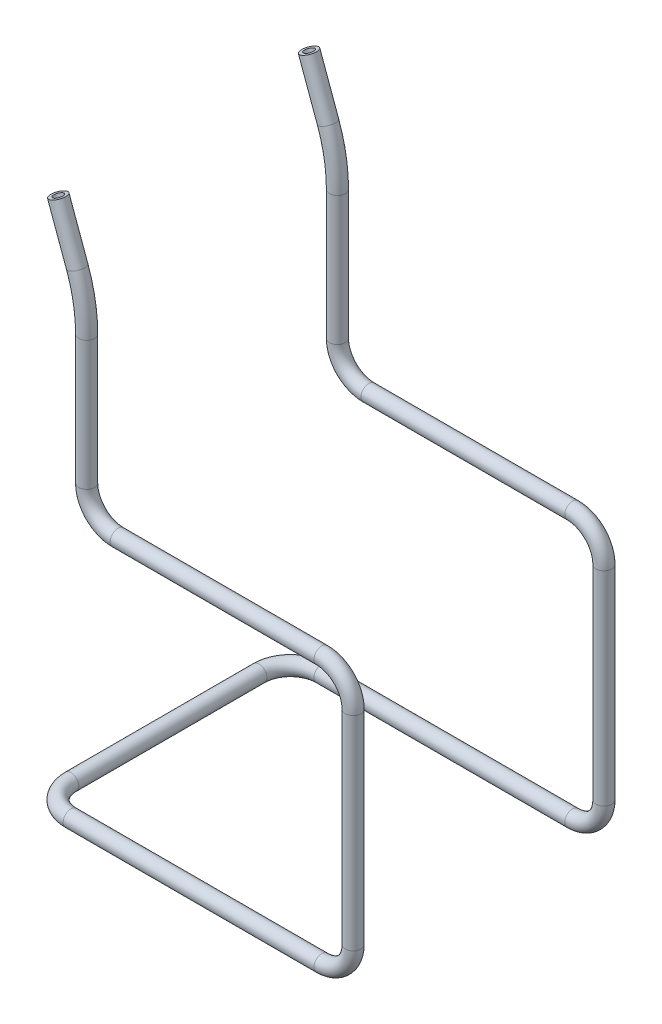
ISO-10303-21;
HEADER;
FILE_DESCRIPTION(('STEP AP214'),'2;1');
FILE_NAME('part.step','',(''),(''),'','','');
FILE_SCHEMA(('AUTOMOTIVE_DESIGN { 1 0 10303 214 1 1 1 1 }'));
ENDSEC;
DATA;
#1=APPLICATION_CONTEXT('core data for automotive mechanical design processes');
#2=APPLICATION_PROTOCOL_DEFINITION('international standard','automotive_design',2000,#1);
#3=PRODUCT_CONTEXT('',#1,'mechanical');
#4=PRODUCT('Part','Part','',(#3));
#5=PRODUCT_RELATED_PRODUCT_CATEGORY('part','',(#4));
#6=PRODUCT_DEFINITION_FORMATION('','',#4);
#7=PRODUCT_DEFINITION_CONTEXT('part definition',#1,'design');
#8=PRODUCT_DEFINITION('design','',#6,#7);
#9=PRODUCT_DEFINITION_SHAPE('','',#8);
#10=(LENGTH_UNIT() NAMED_UNIT(*) SI_UNIT(.MILLI.,.METRE.));
#11=(NAMED_UNIT(*) PLANE_ANGLE_UNIT() SI_UNIT($,.RADIAN.));
#12=(NAMED_UNIT(*) SI_UNIT($,.STERADIAN.) SOLID_ANGLE_UNIT());
#13=UNCERTAINTY_MEASURE_WITH_UNIT(LENGTH_MEASURE(1.E-05),#10,'distance_accuracy_value','');
#14=(GEOMETRIC_REPRESENTATION_CONTEXT(3) GLOBAL_UNCERTAINTY_ASSIGNED_CONTEXT((#13)) GLOBAL_UNIT_ASSIGNED_CONTEXT((#10,
#11,#12)) REPRESENTATION_CONTEXT('',''));
#15=CARTESIAN_POINT('',(0.,0.,0.));
#16=DIRECTION('',(0.,0.,1.));
#17=DIRECTION('',(1.,0.,0.));
#18=AXIS2_PLACEMENT_3D('',#15,#16,#17);
#19=CARTESIAN_POINT('',(11.9846310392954,153.279120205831,40.));
#20=DIRECTION('',(-0.342020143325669,0.939692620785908,0.));
#21=DIRECTION('',(-0.939692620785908,-0.342020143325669,0.));
#22=AXIS2_PLACEMENT_3D('',#19,#20,#21);
#23=CYLINDRICAL_SURFACE('',#22,2.5);
#24=CARTESIAN_POINT('',(11.9846310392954,153.279120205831,40.));
#25=DIRECTION('',(-0.342020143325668,0.939692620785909,0.));
#26=DIRECTION('',(0.,0.,-1.));
#27=AXIS2_PLACEMENT_3D('',#24,#25,#26);
#28=CIRCLE('',#27,2.5);
#29=CARTESIAN_POINT('',(14.3338625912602,154.134170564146,40.));
#30=VERTEX_POINT('',#29);
#31=EDGE_CURVE('E36',#30,#30,#28,.T.);
#32=ORIENTED_EDGE('',*,*,#31,.T.);
#33=EDGE_LOOP('',(#32));
#34=FACE_BOUND('',#33,.T.);
#35=CARTESIAN_POINT('',(5.93646620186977,169.896316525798,40.));
#36=DIRECTION('',(-0.342020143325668,0.939692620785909,0.));
#37=DIRECTION('',(0.,0.,-1.));
#38=AXIS2_PLACEMENT_3D('',#35,#36,#37);
#39=CIRCLE('',#38,2.5);
#40=CARTESIAN_POINT('',(5.93646620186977,169.896316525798,37.5));
#41=VERTEX_POINT('',#40);
#42=EDGE_CURVE('E10',#41,#41,#39,.T.);
#43=ORIENTED_EDGE('',*,*,#42,.F.);
#44=EDGE_LOOP('',(#43));
#45=FACE_BOUND('',#44,.T.);
#46=ADVANCED_FACE('F30',(#34,#45),#23,.T.);
#47=CARTESIAN_POINT('',(-35.,136.178113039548,40.));
#48=DIRECTION('',(0.,0.,1.));
#49=DIRECTION('',(1.,0.,0.));
#50=AXIS2_PLACEMENT_3D('',#47,#48,#49);
#51=TOROIDAL_SURFACE('',#50,50.,2.5);
#52=CARTESIAN_POINT('',(15.,136.178113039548,40.));
#53=DIRECTION('',(0.,1.,0.));
#54=DIRECTION('',(0.,0.,-1.));
#55=AXIS2_PLACEMENT_3D('',#52,#53,#54);
#56=CIRCLE('',#55,2.5);
#57=CARTESIAN_POINT('',(17.5,136.178113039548,40.));
#58=VERTEX_POINT('',#57);
#59=EDGE_CURVE('E40',#58,#58,#56,.T.);
#60=CARTESIAN_POINT('',(-35.,136.178113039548,40.));
#61=DIRECTION('',(0.,0.,1.));
#62=DIRECTION('',(1.,0.,0.));
#63=AXIS2_PLACEMENT_3D('',#60,#61,#62);
#64=CIRCLE('',#63,52.5);
#65=EDGE_CURVE('',#58,#30,#64,.T.);
#66=ORIENTED_EDGE('',*,*,#59,.T.);
#67=ORIENTED_EDGE('',*,*,#31,.F.);
#68=ORIENTED_EDGE('',*,*,#65,.T.);
#69=ORIENTED_EDGE('',*,*,#65,.F.);
#70=EDGE_LOOP('',(#66,#68,#67,#69));
#71=FACE_BOUND('',#70,.T.);
#72=ADVANCED_FACE('F188',(#71),#51,.T.);
#73=CARTESIAN_POINT('',(15.,95.,40.));
#74=DIRECTION('',(0.,1.,0.));
#75=DIRECTION('',(0.,0.,1.));
#76=AXIS2_PLACEMENT_3D('',#73,#74,#75);
#77=CYLINDRICAL_SURFACE('',#76,2.5);
#78=CARTESIAN_POINT('',(15.,95.,40.));
#79=DIRECTION('',(0.,1.,0.));
#80=DIRECTION('',(0.,0.,-1.));
#81=AXIS2_PLACEMENT_3D('',#78,#79,#80);
#82=CIRCLE('',#81,2.5);
#83=CARTESIAN_POINT('',(12.5,95.,40.));
#84=VERTEX_POINT('',#83);
#85=EDGE_CURVE('E44',#84,#84,#82,.T.);
#86=ORIENTED_EDGE('',*,*,#85,.T.);
#87=EDGE_LOOP('',(#86));
#88=FACE_BOUND('',#87,.T.);
#89=ORIENTED_EDGE('',*,*,#59,.F.);
#90=EDGE_LOOP('',(#89));
#91=FACE_BOUND('',#90,.T.);
#92=ADVANCED_FACE('F192',(#88,#91),#77,.T.);
#93=CARTESIAN_POINT('',(25.,95.,40.));
#94=DIRECTION('',(0.,0.,-1.));
#95=DIRECTION('',(-1.,0.,0.));
#96=AXIS2_PLACEMENT_3D('',#93,#94,#95);
#97=TOROIDAL_SURFACE('',#96,10.,2.5);
#98=CARTESIAN_POINT('',(25.,85.,40.));
#99=DIRECTION('',(-1.,0.,0.));
#100=DIRECTION('',(0.,0.,-1.));
#101=AXIS2_PLACEMENT_3D('',#98,#99,#100);
#102=CIRCLE('',#101,2.5);
#103=CARTESIAN_POINT('',(25.,82.5,40.));
#104=VERTEX_POINT('',#103);
#105=EDGE_CURVE('E49',#104,#104,#102,.T.);
#106=CARTESIAN_POINT('',(25.,95.,40.));
#107=DIRECTION('',(0.,0.,-1.));
#108=DIRECTION('',(-1.,0.,0.));
#109=AXIS2_PLACEMENT_3D('',#106,#107,#108);
#110=CIRCLE('',#109,12.5);
#111=EDGE_CURVE('',#104,#84,#110,.T.);
#112=ORIENTED_EDGE('',*,*,#105,.T.);
#113=ORIENTED_EDGE('',*,*,#85,.F.);
#114=ORIENTED_EDGE('',*,*,#111,.T.);
#115=ORIENTED_EDGE('',*,*,#111,.F.);
#116=EDGE_LOOP('',(#112,#114,#113,#115));
#117=FACE_BOUND('',#116,.T.);
#118=ADVANCED_FACE('F198',(#117),#97,.T.);
#119=CARTESIAN_POINT('',(90.,85.,40.));
#120=DIRECTION('',(-1.,0.,0.));
#121=DIRECTION('',(0.,0.,1.));
#122=AXIS2_PLACEMENT_3D('',#119,#120,#121);
#123=CYLINDRICAL_SURFACE('',#122,2.5);
#124=CARTESIAN_POINT('',(90.,85.,40.));
#125=DIRECTION('',(-1.,0.,0.));
#126=DIRECTION('',(0.,0.,-1.));
#127=AXIS2_PLACEMENT_3D('',#124,#125,#126);
#128=CIRCLE('',#127,2.5);
#129=CARTESIAN_POINT('',(90.,87.5,40.));
#130=VERTEX_POINT('',#129);
#131=EDGE_CURVE('E52',#130,#130,#128,.T.);
#132=ORIENTED_EDGE('',*,*,#131,.T.);
#133=EDGE_LOOP('',(#132));
#134=FACE_BOUND('',#133,.T.);
#135=ORIENTED_EDGE('',*,*,#105,.F.);
#136=EDGE_LOOP('',(#135));
#137=FACE_BOUND('',#136,.T.);
#138=ADVANCED_FACE('F205',(#134,#137),#123,.T.);
#139=CARTESIAN_POINT('',(90.,75.,40.));
#140=DIRECTION('',(0.,0.,1.));
#141=DIRECTION('',(1.,0.,0.));
#142=AXIS2_PLACEMENT_3D('',#139,#140,#141);
#143=TOROIDAL_SURFACE('',#142,9.99999999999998,2.5);
#144=CARTESIAN_POINT('',(100.,75.,40.));
#145=DIRECTION('',(0.,1.,0.));
#146=DIRECTION('',(0.,0.,-1.));
#147=AXIS2_PLACEMENT_3D('',#144,#145,#146);
#148=CIRCLE('',#147,2.5);
#149=CARTESIAN_POINT('',(102.5,75.,40.));
#150=VERTEX_POINT('',#149);
#151=EDGE_CURVE('E55',#150,#150,#148,.T.);
#152=CARTESIAN_POINT('',(90.,75.,40.));
#153=DIRECTION('',(0.,0.,1.));
#154=DIRECTION('',(1.,0.,0.));
#155=AXIS2_PLACEMENT_3D('',#152,#153,#154);
#156=CIRCLE('',#155,12.5);
#157=EDGE_CURVE('',#150,#130,#156,.T.);
#158=ORIENTED_EDGE('',*,*,#151,.T.);
#159=ORIENTED_EDGE('',*,*,#131,.F.);
#160=ORIENTED_EDGE('',*,*,#157,.T.);
#161=ORIENTED_EDGE('',*,*,#157,.F.);
#162=EDGE_LOOP('',(#158,#160,#159,#161));
#163=FACE_BOUND('',#162,.T.);
#164=ADVANCED_FACE('F209',(#163),#143,.T.);
#165=CARTESIAN_POINT('',(100.,9.99999999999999,40.));
#166=DIRECTION('',(0.,1.,0.));
#167=DIRECTION('',(0.,0.,1.));
#168=AXIS2_PLACEMENT_3D('',#165,#166,#167);
#169=CYLINDRICAL_SURFACE('',#168,2.5);
#170=CARTESIAN_POINT('',(100.,9.99999999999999,40.));
#171=DIRECTION('',(0.,1.,0.));
#172=DIRECTION('',(0.,0.,-1.));
#173=AXIS2_PLACEMENT_3D('',#170,#171,#172);
#174=CIRCLE('',#173,2.5);
#175=CARTESIAN_POINT('',(102.5,9.99999999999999,40.));
#176=VERTEX_POINT('',#175);
#177=EDGE_CURVE('E58',#176,#176,#174,.T.);
#178=ORIENTED_EDGE('',*,*,#177,.T.);
#179=EDGE_LOOP('',(#178));
#180=FACE_BOUND('',#179,.T.);
#181=ORIENTED_EDGE('',*,*,#151,.F.);
#182=EDGE_LOOP('',(#181));
#183=FACE_BOUND('',#182,.T.);
#184=ADVANCED_FACE('F213',(#180,#183),#169,.T.);
#185=CARTESIAN_POINT('',(90.,10.,40.));
#186=DIRECTION('',(0.,0.,1.));
#187=DIRECTION('',(1.,0.,0.));
#188=AXIS2_PLACEMENT_3D('',#185,#186,#187);
#189=TOROIDAL_SURFACE('',#188,10.,2.5);
#190=CARTESIAN_POINT('',(90.,0.,40.));
#191=DIRECTION('',(1.,0.,0.));
#192=DIRECTION('',(0.,0.,-1.));
#193=AXIS2_PLACEMENT_3D('',#190,#191,#192);
#194=CIRCLE('',#193,2.5);
#195=CARTESIAN_POINT('',(90.,-2.5,40.));
#196=VERTEX_POINT('',#195);
#197=EDGE_CURVE('E61',#196,#196,#194,.T.);
#198=CARTESIAN_POINT('',(90.,10.,40.));
#199=DIRECTION('',(0.,0.,1.));
#200=DIRECTION('',(1.,0.,0.));
#201=AXIS2_PLACEMENT_3D('',#198,#199,#200);
#202=CIRCLE('',#201,12.5);
#203=EDGE_CURVE('',#196,#176,#202,.T.);
#204=ORIENTED_EDGE('',*,*,#197,.T.);
#205=ORIENTED_EDGE('',*,*,#177,.F.);
#206=ORIENTED_EDGE('',*,*,#203,.T.);
#207=ORIENTED_EDGE('',*,*,#203,.F.);
#208=EDGE_LOOP('',(#204,#206,#205,#207));
#209=FACE_BOUND('',#208,.T.);
#210=ADVANCED_FACE('F217',(#209),#189,.T.);
#211=CARTESIAN_POINT('',(10.,0.,40.));
#212=DIRECTION('',(1.,0.,0.));
#213=DIRECTION('',(0.,0.,-1.));
#214=AXIS2_PLACEMENT_3D('',#211,#212,#213);
#215=CYLINDRICAL_SURFACE('',#214,2.5);
#216=CARTESIAN_POINT('',(10.,0.,40.));
#217=DIRECTION('',(1.,0.,0.));
#218=DIRECTION('',(0.,0.,-1.));
#219=AXIS2_PLACEMENT_3D('',#216,#217,#218);
#220=CIRCLE('',#219,2.5);
#221=CARTESIAN_POINT('',(10.,0.,42.5));
#222=VERTEX_POINT('',#221);
#223=EDGE_CURVE('E64',#222,#222,#220,.T.);
#224=ORIENTED_EDGE('',*,*,#223,.T.);
#225=EDGE_LOOP('',(#224));
#226=FACE_BOUND('',#225,.T.);
#227=ORIENTED_EDGE('',*,*,#197,.F.);
#228=EDGE_LOOP('',(#227));
#229=FACE_BOUND('',#228,.T.);
#230=ADVANCED_FACE('F221',(#226,#229),#215,.T.);
#231=CARTESIAN_POINT('',(10.,0.,30.));
#232=DIRECTION('',(0.,1.,0.));
#233=DIRECTION('',(0.,0.,1.));
#234=AXIS2_PLACEMENT_3D('',#231,#232,#233);
#235=TOROIDAL_SURFACE('',#234,10.,2.5);
#236=CARTESIAN_POINT('',(0.,0.,30.));
#237=DIRECTION('',(0.,0.,1.));
#238=DIRECTION('',(1.,0.,0.));
#239=AXIS2_PLACEMENT_3D('',#236,#237,#238);
#240=CIRCLE('',#239,2.5);
#241=CARTESIAN_POINT('',(-2.5,0.,30.));
#242=VERTEX_POINT('',#241);
#243=EDGE_CURVE('E67',#242,#242,#240,.T.);
#244=CARTESIAN_POINT('',(10.,0.,30.));
#245=DIRECTION('',(0.,1.,0.));
#246=DIRECTION('',(0.,0.,1.));
#247=AXIS2_PLACEMENT_3D('',#244,#245,#246);
#248=CIRCLE('',#247,12.5);
#249=EDGE_CURVE('',#242,#222,#248,.T.);
#250=ORIENTED_EDGE('',*,*,#243,.T.);
#251=ORIENTED_EDGE('',*,*,#223,.F.);
#252=ORIENTED_EDGE('',*,*,#249,.T.);
#253=ORIENTED_EDGE('',*,*,#249,.F.);
#254=EDGE_LOOP('',(#250,#252,#251,#253));
#255=FACE_BOUND('',#254,.T.);
#256=ADVANCED_FACE('F225',(#255),#235,.T.);
#257=CARTESIAN_POINT('',(0.,0.,30.));
#258=DIRECTION('',(0.,0.,-1.));
#259=DIRECTION('',(-1.,0.,0.));
#260=AXIS2_PLACEMENT_3D('',#257,#258,#259);
#261=CYLINDRICAL_SURFACE('',#260,2.5);
#262=ORIENTED_EDGE('',*,*,#243,.F.);
#263=EDGE_LOOP('',(#262));
#264=FACE_BOUND('',#263,.T.);
#265=CARTESIAN_POINT('',(0.,0.,-30.));
#266=DIRECTION('',(0.,0.,1.));
#267=DIRECTION('',(1.,0.,0.));
#268=AXIS2_PLACEMENT_3D('',#265,#266,#267);
#269=CIRCLE('',#268,2.5);
#270=CARTESIAN_POINT('',(-2.5,0.,-30.));
#271=VERTEX_POINT('',#270);
#272=EDGE_CURVE('E133',#271,#271,#269,.T.);
#273=ORIENTED_EDGE('',*,*,#272,.T.);
#274=EDGE_LOOP('',(#273));
#275=FACE_BOUND('',#274,.T.);
#276=ADVANCED_FACE('F229',(#264,#275),#261,.T.);
#277=CARTESIAN_POINT('',(5.93646620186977,169.896316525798,40.));
#278=DIRECTION('',(-0.342020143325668,0.939692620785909,0.));
#279=DIRECTION('',(0.,0.,-1.));
#280=AXIS2_PLACEMENT_3D('',#277,#278,#279);
#281=PLANE('',#280);
#282=CARTESIAN_POINT('',(5.93646620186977,169.896316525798,40.));
#283=DIRECTION('',(-0.342020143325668,0.939692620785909,0.));
#284=DIRECTION('',(-0.939692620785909,-0.342020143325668,0.));
#285=AXIS2_PLACEMENT_3D('',#282,#283,#284);
#286=CIRCLE('',#285,1.5);
#287=CARTESIAN_POINT('',(4.5269272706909,169.383286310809,40.));
#288=VERTEX_POINT('',#287);
#289=EDGE_CURVE('E70',#288,#288,#286,.T.);
#290=ORIENTED_EDGE('',*,*,#289,.F.);
#291=EDGE_LOOP('',(#290));
#292=FACE_BOUND('',#291,.T.);
#293=ORIENTED_EDGE('',*,*,#42,.T.);
#294=EDGE_LOOP('',(#293));
#295=FACE_BOUND('',#294,.T.);
#296=ADVANCED_FACE('F233',(#292,#295),#281,.T.);
#297=CARTESIAN_POINT('',(11.9846310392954,153.279120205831,40.));
#298=DIRECTION('',(-0.342020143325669,0.939692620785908,0.));
#299=DIRECTION('',(-0.939692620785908,-0.342020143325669,0.));
#300=AXIS2_PLACEMENT_3D('',#297,#298,#299);
#301=CYLINDRICAL_SURFACE('',#300,1.5);
#302=CARTESIAN_POINT('',(11.9846310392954,153.279120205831,40.));
#303=DIRECTION('',(-0.342020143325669,0.939692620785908,0.));
#304=DIRECTION('',(-0.939692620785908,-0.342020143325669,0.));
#305=AXIS2_PLACEMENT_3D('',#302,#303,#304);
#306=CIRCLE('',#305,1.5);
#307=CARTESIAN_POINT('',(13.3941699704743,153.79215042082,40.));
#308=VERTEX_POINT('',#307);
#309=EDGE_CURVE('E73',#308,#308,#306,.T.);
#310=ORIENTED_EDGE('',*,*,#309,.F.);
#311=EDGE_LOOP('',(#310));
#312=FACE_BOUND('',#311,.T.);
#313=ORIENTED_EDGE('',*,*,#289,.T.);
#314=EDGE_LOOP('',(#313));
#315=FACE_BOUND('',#314,.T.);
#316=ADVANCED_FACE('F237',(#312,#315),#301,.F.);
#317=CARTESIAN_POINT('',(-35.,136.178113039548,40.));
#318=DIRECTION('',(0.,0.,1.));
#319=DIRECTION('',(1.,0.,0.));
#320=AXIS2_PLACEMENT_3D('',#317,#318,#319);
#321=TOROIDAL_SURFACE('',#320,50.,1.5);
#322=CARTESIAN_POINT('',(15.,136.178113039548,40.));
#323=DIRECTION('',(0.,-1.,0.));
#324=DIRECTION('',(1.,0.,0.));
#325=AXIS2_PLACEMENT_3D('',#322,#323,#324);
#326=CIRCLE('',#325,1.5);
#327=CARTESIAN_POINT('',(16.5,136.178113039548,40.));
#328=VERTEX_POINT('',#327);
#329=EDGE_CURVE('E99',#328,#328,#326,.F.);
#330=CARTESIAN_POINT('',(-35.,136.178113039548,40.));
#331=DIRECTION('',(0.,0.,1.));
#332=DIRECTION('',(1.,0.,0.));
#333=AXIS2_PLACEMENT_3D('',#330,#331,#332);
#334=CIRCLE('',#333,51.5);
#335=EDGE_CURVE('',#328,#308,#334,.T.);
#336=ORIENTED_EDGE('',*,*,#329,.F.);
#337=ORIENTED_EDGE('',*,*,#309,.T.);
#338=ORIENTED_EDGE('',*,*,#335,.T.);
#339=ORIENTED_EDGE('',*,*,#335,.F.);
#340=EDGE_LOOP('',(#336,#338,#337,#339));
#341=FACE_BOUND('',#340,.T.);
#342=ADVANCED_FACE('F275',(#341),#321,.F.);
#343=CARTESIAN_POINT('',(15.,95.,40.));
#344=DIRECTION('',(0.,1.,0.));
#345=DIRECTION('',(0.,0.,1.));
#346=AXIS2_PLACEMENT_3D('',#343,#344,#345);
#347=CYLINDRICAL_SURFACE('',#346,1.5);
#348=CARTESIAN_POINT('',(15.,95.,40.));
#349=DIRECTION('',(0.,1.,0.));
#350=DIRECTION('',(0.,0.,1.));
#351=AXIS2_PLACEMENT_3D('',#348,#349,#350);
#352=CIRCLE('',#351,1.5);
#353=CARTESIAN_POINT('',(13.5,95.,40.));
#354=VERTEX_POINT('',#353);
#355=EDGE_CURVE('E96',#354,#354,#352,.T.);
#356=ORIENTED_EDGE('',*,*,#355,.F.);
#357=EDGE_LOOP('',(#356));
#358=FACE_BOUND('',#357,.T.);
#359=ORIENTED_EDGE('',*,*,#329,.T.);
#360=EDGE_LOOP('',(#359));
#361=FACE_BOUND('',#360,.T.);
#362=ADVANCED_FACE('F271',(#358,#361),#347,.F.);
#363=CARTESIAN_POINT('',(25.,95.,40.));
#364=DIRECTION('',(0.,0.,-1.));
#365=DIRECTION('',(-1.,0.,0.));
#366=AXIS2_PLACEMENT_3D('',#363,#364,#365);
#367=TOROIDAL_SURFACE('',#366,10.,1.5);
#368=CARTESIAN_POINT('',(25.,85.,40.));
#369=DIRECTION('',(1.,0.,0.));
#370=DIRECTION('',(0.,1.,0.));
#371=AXIS2_PLACEMENT_3D('',#368,#369,#370);
#372=CIRCLE('',#371,1.5);
#373=CARTESIAN_POINT('',(25.,83.5,40.));
#374=VERTEX_POINT('',#373);
#375=EDGE_CURVE('E93',#374,#374,#372,.F.);
#376=CARTESIAN_POINT('',(25.,95.,40.));
#377=DIRECTION('',(0.,0.,-1.));
#378=DIRECTION('',(-1.,0.,0.));
#379=AXIS2_PLACEMENT_3D('',#376,#377,#378);
#380=CIRCLE('',#379,11.5);
#381=EDGE_CURVE('',#374,#354,#380,.T.);
#382=ORIENTED_EDGE('',*,*,#375,.F.);
#383=ORIENTED_EDGE('',*,*,#355,.T.);
#384=ORIENTED_EDGE('',*,*,#381,.T.);
#385=ORIENTED_EDGE('',*,*,#381,.F.);
#386=EDGE_LOOP('',(#382,#384,#383,#385));
#387=FACE_BOUND('',#386,.T.);
#388=ADVANCED_FACE('F267',(#387),#367,.F.);
#389=CARTESIAN_POINT('',(90.,85.,40.));
#390=DIRECTION('',(-1.,0.,0.));
#391=DIRECTION('',(0.,0.,1.));
#392=AXIS2_PLACEMENT_3D('',#389,#390,#391);
#393=CYLINDRICAL_SURFACE('',#392,1.5);
#394=CARTESIAN_POINT('',(90.,85.,40.));
#395=DIRECTION('',(-1.,0.,0.));
#396=DIRECTION('',(0.,0.,1.));
#397=AXIS2_PLACEMENT_3D('',#394,#395,#396);
#398=CIRCLE('',#397,1.5);
#399=CARTESIAN_POINT('',(90.,86.5,40.));
#400=VERTEX_POINT('',#399);
#401=EDGE_CURVE('E90',#400,#400,#398,.T.);
#402=ORIENTED_EDGE('',*,*,#401,.F.);
#403=EDGE_LOOP('',(#402));
#404=FACE_BOUND('',#403,.T.);
#405=ORIENTED_EDGE('',*,*,#375,.T.);
#406=EDGE_LOOP('',(#405));
#407=FACE_BOUND('',#406,.T.);
#408=ADVANCED_FACE('F263',(#404,#407),#393,.F.);
#409=CARTESIAN_POINT('',(90.,75.,40.));
#410=DIRECTION('',(0.,0.,1.));
#411=DIRECTION('',(1.,0.,0.));
#412=AXIS2_PLACEMENT_3D('',#409,#410,#411);
#413=TOROIDAL_SURFACE('',#412,9.99999999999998,1.5);
#414=CARTESIAN_POINT('',(100.,75.,40.));
#415=DIRECTION('',(0.,-1.,0.));
#416=DIRECTION('',(0.,0.,-1.));
#417=AXIS2_PLACEMENT_3D('',#414,#415,#416);
#418=CIRCLE('',#417,1.5);
#419=CARTESIAN_POINT('',(101.5,75.,40.));
#420=VERTEX_POINT('',#419);
#421=EDGE_CURVE('E87',#420,#420,#418,.F.);
#422=CARTESIAN_POINT('',(90.,75.,40.));
#423=DIRECTION('',(0.,0.,1.));
#424=DIRECTION('',(1.,0.,0.));
#425=AXIS2_PLACEMENT_3D('',#422,#423,#424);
#426=CIRCLE('',#425,11.5);
#427=EDGE_CURVE('',#420,#400,#426,.T.);
#428=ORIENTED_EDGE('',*,*,#421,.F.);
#429=ORIENTED_EDGE('',*,*,#401,.T.);
#430=ORIENTED_EDGE('',*,*,#427,.T.);
#431=ORIENTED_EDGE('',*,*,#427,.F.);
#432=EDGE_LOOP('',(#428,#430,#429,#431));
#433=FACE_BOUND('',#432,.T.);
#434=ADVANCED_FACE('F259',(#433),#413,.F.);
#435=CARTESIAN_POINT('',(100.,9.99999999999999,40.));
#436=DIRECTION('',(0.,1.,0.));
#437=DIRECTION('',(0.,0.,1.));
#438=AXIS2_PLACEMENT_3D('',#435,#436,#437);
#439=CYLINDRICAL_SURFACE('',#438,1.5);
#440=CARTESIAN_POINT('',(100.,9.99999999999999,40.));
#441=DIRECTION('',(0.,1.,0.));
#442=DIRECTION('',(0.,0.,1.));
#443=AXIS2_PLACEMENT_3D('',#440,#441,#442);
#444=CIRCLE('',#443,1.5);
#445=CARTESIAN_POINT('',(101.5,9.99999999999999,40.));
#446=VERTEX_POINT('',#445);
#447=EDGE_CURVE('E84',#446,#446,#444,.T.);
#448=ORIENTED_EDGE('',*,*,#447,.F.);
#449=EDGE_LOOP('',(#448));
#450=FACE_BOUND('',#449,.T.);
#451=ORIENTED_EDGE('',*,*,#421,.T.);
#452=EDGE_LOOP('',(#451));
#453=FACE_BOUND('',#452,.T.);
#454=ADVANCED_FACE('F255',(#450,#453),#439,.F.);
#455=CARTESIAN_POINT('',(90.,10.,40.));
#456=DIRECTION('',(0.,0.,1.));
#457=DIRECTION('',(1.,0.,0.));
#458=AXIS2_PLACEMENT_3D('',#455,#456,#457);
#459=TOROIDAL_SURFACE('',#458,10.,1.5);
#460=CARTESIAN_POINT('',(90.,0.,40.));
#461=DIRECTION('',(-1.,0.,0.));
#462=DIRECTION('',(0.,-1.,0.));
#463=AXIS2_PLACEMENT_3D('',#460,#461,#462);
#464=CIRCLE('',#463,1.5);
#465=CARTESIAN_POINT('',(90.,-1.5,40.));
#466=VERTEX_POINT('',#465);
#467=EDGE_CURVE('E81',#466,#466,#464,.F.);
#468=CARTESIAN_POINT('',(90.,10.,40.));
#469=DIRECTION('',(0.,0.,1.));
#470=DIRECTION('',(1.,0.,0.));
#471=AXIS2_PLACEMENT_3D('',#468,#469,#470);
#472=CIRCLE('',#471,11.5);
#473=EDGE_CURVE('',#466,#446,#472,.T.);
#474=ORIENTED_EDGE('',*,*,#467,.F.);
#475=ORIENTED_EDGE('',*,*,#447,.T.);
#476=ORIENTED_EDGE('',*,*,#473,.T.);
#477=ORIENTED_EDGE('',*,*,#473,.F.);
#478=EDGE_LOOP('',(#474,#476,#475,#477));
#479=FACE_BOUND('',#478,.T.);
#480=ADVANCED_FACE('F251',(#479),#459,.F.);
#481=CARTESIAN_POINT('',(10.,0.,40.));
#482=DIRECTION('',(1.,0.,0.));
#483=DIRECTION('',(0.,0.,-1.));
#484=AXIS2_PLACEMENT_3D('',#481,#482,#483);
#485=CYLINDRICAL_SURFACE('',#484,1.5);
#486=CARTESIAN_POINT('',(10.,0.,40.));
#487=DIRECTION('',(1.,0.,0.));
#488=DIRECTION('',(0.,0.,-1.));
#489=AXIS2_PLACEMENT_3D('',#486,#487,#488);
#490=CIRCLE('',#489,1.5);
#491=CARTESIAN_POINT('',(10.,0.,41.5));
#492=VERTEX_POINT('',#491);
#493=EDGE_CURVE('E77',#492,#492,#490,.T.);
#494=ORIENTED_EDGE('',*,*,#493,.F.);
#495=EDGE_LOOP('',(#494));
#496=FACE_BOUND('',#495,.T.);
#497=ORIENTED_EDGE('',*,*,#467,.T.);
#498=EDGE_LOOP('',(#497));
#499=FACE_BOUND('',#498,.T.);
#500=ADVANCED_FACE('F247',(#496,#499),#485,.F.);
#501=CARTESIAN_POINT('',(10.,0.,30.));
#502=DIRECTION('',(0.,1.,0.));
#503=DIRECTION('',(0.,0.,1.));
#504=AXIS2_PLACEMENT_3D('',#501,#502,#503);
#505=TOROIDAL_SURFACE('',#504,10.,1.5);
#506=CARTESIAN_POINT('',(0.,0.,30.));
#507=DIRECTION('',(0.,0.,-1.));
#508=DIRECTION('',(-1.,0.,0.));
#509=AXIS2_PLACEMENT_3D('',#506,#507,#508);
#510=CIRCLE('',#509,1.5);
#511=CARTESIAN_POINT('',(-1.5,0.,30.));
#512=VERTEX_POINT('',#511);
#513=EDGE_CURVE('E74',#512,#512,#510,.F.);
#514=CARTESIAN_POINT('',(10.,0.,30.));
#515=DIRECTION('',(0.,1.,0.));
#516=DIRECTION('',(0.,0.,1.));
#517=AXIS2_PLACEMENT_3D('',#514,#515,#516);
#518=CIRCLE('',#517,11.5);
#519=EDGE_CURVE('',#512,#492,#518,.T.);
#520=ORIENTED_EDGE('',*,*,#513,.F.);
#521=ORIENTED_EDGE('',*,*,#493,.T.);
#522=ORIENTED_EDGE('',*,*,#519,.T.);
#523=ORIENTED_EDGE('',*,*,#519,.F.);
#524=EDGE_LOOP('',(#520,#522,#521,#523));
#525=FACE_BOUND('',#524,.T.);
#526=ADVANCED_FACE('F243',(#525),#505,.F.);
#527=CARTESIAN_POINT('',(0.,0.,30.));
#528=DIRECTION('',(0.,0.,-1.));
#529=DIRECTION('',(-1.,0.,0.));
#530=AXIS2_PLACEMENT_3D('',#527,#528,#529);
#531=CYLINDRICAL_SURFACE('',#530,1.5);
#532=ORIENTED_EDGE('',*,*,#513,.T.);
#533=EDGE_LOOP('',(#532));
#534=FACE_BOUND('',#533,.T.);
#535=CARTESIAN_POINT('',(0.,0.,-30.));
#536=DIRECTION('',(0.,0.,1.));
#537=DIRECTION('',(1.,0.,0.));
#538=AXIS2_PLACEMENT_3D('',#535,#536,#537);
#539=CIRCLE('',#538,1.5);
#540=CARTESIAN_POINT('',(-1.5,0.,-30.));
#541=VERTEX_POINT('',#540);
#542=EDGE_CURVE('E140',#541,#541,#539,.T.);
#543=ORIENTED_EDGE('',*,*,#542,.F.);
#544=EDGE_LOOP('',(#543));
#545=FACE_BOUND('',#544,.T.);
#546=ADVANCED_FACE('F239',(#534,#545),#531,.F.);
#547=CARTESIAN_POINT('',(5.93646620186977,169.896316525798,-40.));
#548=DIRECTION('',(-0.342020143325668,0.939692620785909,0.));
#549=DIRECTION('',(0.,0.,1.));
#550=AXIS2_PLACEMENT_3D('',#547,#548,#549);
#551=PLANE('',#550);
#552=CARTESIAN_POINT('',(5.93646620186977,169.896316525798,-40.));
#553=DIRECTION('',(0.342020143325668,-0.939692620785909,0.));
#554=DIRECTION('',(0.,0.,1.));
#555=AXIS2_PLACEMENT_3D('',#552,#553,#554);
#556=CIRCLE('',#555,2.5);
#557=CARTESIAN_POINT('',(5.93646620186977,169.896316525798,-37.5));
#558=VERTEX_POINT('',#557);
#559=EDGE_CURVE('E78',#558,#558,#556,.T.);
#560=ORIENTED_EDGE('',*,*,#559,.F.);
#561=EDGE_LOOP('',(#560));
#562=FACE_BOUND('',#561,.T.);
#563=CARTESIAN_POINT('',(5.93646620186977,169.896316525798,-40.));
#564=DIRECTION('',(-0.342020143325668,0.939692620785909,0.));
#565=DIRECTION('',(-0.939692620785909,-0.342020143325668,0.));
#566=AXIS2_PLACEMENT_3D('',#563,#564,#565);
#567=CIRCLE('',#566,1.5);
#568=CARTESIAN_POINT('',(4.5269272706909,169.383286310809,-40.));
#569=VERTEX_POINT('',#568);
#570=EDGE_CURVE('E136',#569,#569,#567,.F.);
#571=ORIENTED_EDGE('',*,*,#570,.T.);
#572=EDGE_LOOP('',(#571));
#573=FACE_BOUND('',#572,.T.);
#574=ADVANCED_FACE('F242',(#562,#573),#551,.T.);
#575=CARTESIAN_POINT('',(11.9846310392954,153.279120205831,-40.));
#576=DIRECTION('',(-0.342020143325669,0.939692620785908,0.));
#577=DIRECTION('',(-0.939692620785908,-0.342020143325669,0.));
#578=AXIS2_PLACEMENT_3D('',#575,#576,#577);
#579=CYLINDRICAL_SURFACE('',#578,2.5);
#580=CARTESIAN_POINT('',(11.9846310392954,153.279120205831,-40.));
#581=DIRECTION('',(0.342020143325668,-0.939692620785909,0.));
#582=DIRECTION('',(0.,0.,1.));
#583=AXIS2_PLACEMENT_3D('',#580,#581,#582);
#584=CIRCLE('',#583,2.5);
#585=CARTESIAN_POINT('',(14.3338625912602,154.134170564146,-40.));
#586=VERTEX_POINT('',#585);
#587=EDGE_CURVE('E106',#586,#586,#584,.T.);
#588=ORIENTED_EDGE('',*,*,#587,.F.);
#589=EDGE_LOOP('',(#588));
#590=FACE_BOUND('',#589,.T.);
#591=ORIENTED_EDGE('',*,*,#559,.T.);
#592=EDGE_LOOP('',(#591));
#593=FACE_BOUND('',#592,.T.);
#594=ADVANCED_FACE('F283',(#590,#593),#579,.T.);
#595=CARTESIAN_POINT('',(-35.,136.178113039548,-40.));
#596=DIRECTION('',(0.,0.,1.));
#597=DIRECTION('',(1.,0.,0.));
#598=AXIS2_PLACEMENT_3D('',#595,#596,#597);
#599=TOROIDAL_SURFACE('',#598,50.,2.5);
#600=CARTESIAN_POINT('',(15.,136.178113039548,-40.));
#601=DIRECTION('',(0.,-1.,0.));
#602=DIRECTION('',(0.,0.,1.));
#603=AXIS2_PLACEMENT_3D('',#600,#601,#602);
#604=CIRCLE('',#603,2.5);
#605=CARTESIAN_POINT('',(17.5,136.178113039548,-40.));
#606=VERTEX_POINT('',#605);
#607=EDGE_CURVE('E109',#606,#606,#604,.T.);
#608=CARTESIAN_POINT('',(-35.,136.178113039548,-40.));
#609=DIRECTION('',(0.,0.,1.));
#610=DIRECTION('',(1.,0.,0.));
#611=AXIS2_PLACEMENT_3D('',#608,#609,#610);
#612=CIRCLE('',#611,52.5);
#613=EDGE_CURVE('',#606,#586,#612,.T.);
#614=ORIENTED_EDGE('',*,*,#607,.F.);
#615=ORIENTED_EDGE('',*,*,#587,.T.);
#616=ORIENTED_EDGE('',*,*,#613,.T.);
#617=ORIENTED_EDGE('',*,*,#613,.F.);
#618=EDGE_LOOP('',(#614,#616,#615,#617));
#619=FACE_BOUND('',#618,.T.);
#620=ADVANCED_FACE('F286',(#619),#599,.T.);
#621=CARTESIAN_POINT('',(15.,95.,-40.));
#622=DIRECTION('',(0.,1.,0.));
#623=DIRECTION('',(0.,0.,1.));
#624=AXIS2_PLACEMENT_3D('',#621,#622,#623);
#625=CYLINDRICAL_SURFACE('',#624,2.5);
#626=CARTESIAN_POINT('',(15.,95.,-40.));
#627=DIRECTION('',(0.,-1.,0.));
#628=DIRECTION('',(0.,0.,1.));
#629=AXIS2_PLACEMENT_3D('',#626,#627,#628);
#630=CIRCLE('',#629,2.5);
#631=CARTESIAN_POINT('',(12.5,95.,-40.));
#632=VERTEX_POINT('',#631);
#633=EDGE_CURVE('E112',#632,#632,#630,.T.);
#634=ORIENTED_EDGE('',*,*,#633,.F.);
#635=EDGE_LOOP('',(#634));
#636=FACE_BOUND('',#635,.T.);
#637=ORIENTED_EDGE('',*,*,#607,.T.);
#638=EDGE_LOOP('',(#637));
#639=FACE_BOUND('',#638,.T.);
#640=ADVANCED_FACE('F290',(#636,#639),#625,.T.);
#641=CARTESIAN_POINT('',(25.,95.,-40.));
#642=DIRECTION('',(0.,0.,-1.));
#643=DIRECTION('',(-1.,0.,0.));
#644=AXIS2_PLACEMENT_3D('',#641,#642,#643);
#645=TOROIDAL_SURFACE('',#644,10.,2.5);
#646=CARTESIAN_POINT('',(25.,85.,-40.));
#647=DIRECTION('',(1.,0.,0.));
#648=DIRECTION('',(0.,0.,1.));
#649=AXIS2_PLACEMENT_3D('',#646,#647,#648);
#650=CIRCLE('',#649,2.5);
#651=CARTESIAN_POINT('',(25.,82.5,-40.));
#652=VERTEX_POINT('',#651);
#653=EDGE_CURVE('E115',#652,#652,#650,.T.);
#654=CARTESIAN_POINT('',(25.,95.,-40.));
#655=DIRECTION('',(0.,0.,-1.));
#656=DIRECTION('',(-1.,0.,0.));
#657=AXIS2_PLACEMENT_3D('',#654,#655,#656);
#658=CIRCLE('',#657,12.5);
#659=EDGE_CURVE('',#652,#632,#658,.T.);
#660=ORIENTED_EDGE('',*,*,#653,.F.);
#661=ORIENTED_EDGE('',*,*,#633,.T.);
#662=ORIENTED_EDGE('',*,*,#659,.T.);
#663=ORIENTED_EDGE('',*,*,#659,.F.);
#664=EDGE_LOOP('',(#660,#662,#661,#663));
#665=FACE_BOUND('',#664,.T.);
#666=ADVANCED_FACE('F294',(#665),#645,.T.);
#667=CARTESIAN_POINT('',(90.,85.,-40.));
#668=DIRECTION('',(-1.,0.,0.));
#669=DIRECTION('',(0.,0.,1.));
#670=AXIS2_PLACEMENT_3D('',#667,#668,#669);
#671=CYLINDRICAL_SURFACE('',#670,2.5);
#672=CARTESIAN_POINT('',(90.,85.,-40.));
#673=DIRECTION('',(1.,0.,0.));
#674=DIRECTION('',(0.,0.,1.));
#675=AXIS2_PLACEMENT_3D('',#672,#673,#674);
#676=CIRCLE('',#675,2.5);
#677=CARTESIAN_POINT('',(90.,87.5,-40.));
#678=VERTEX_POINT('',#677);
#679=EDGE_CURVE('E118',#678,#678,#676,.T.);
#680=ORIENTED_EDGE('',*,*,#679,.F.);
#681=EDGE_LOOP('',(#680));
#682=FACE_BOUND('',#681,.T.);
#683=ORIENTED_EDGE('',*,*,#653,.T.);
#684=EDGE_LOOP('',(#683));
#685=FACE_BOUND('',#684,.T.);
#686=ADVANCED_FACE('F298',(#682,#685),#671,.T.);
#687=CARTESIAN_POINT('',(90.,75.,-40.));
#688=DIRECTION('',(0.,0.,1.));
#689=DIRECTION('',(1.,0.,0.));
#690=AXIS2_PLACEMENT_3D('',#687,#688,#689);
#691=TOROIDAL_SURFACE('',#690,9.99999999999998,2.5);
#692=CARTESIAN_POINT('',(100.,75.,-40.));
#693=DIRECTION('',(0.,-1.,0.));
#694=DIRECTION('',(0.,0.,1.));
#695=AXIS2_PLACEMENT_3D('',#692,#693,#694);
#696=CIRCLE('',#695,2.5);
#697=CARTESIAN_POINT('',(102.5,75.,-40.));
#698=VERTEX_POINT('',#697);
#699=EDGE_CURVE('E121',#698,#698,#696,.T.);
#700=CARTESIAN_POINT('',(90.,75.,-40.));
#701=DIRECTION('',(0.,0.,1.));
#702=DIRECTION('',(1.,0.,0.));
#703=AXIS2_PLACEMENT_3D('',#700,#701,#702);
#704=CIRCLE('',#703,12.5);
#705=EDGE_CURVE('',#698,#678,#704,.T.);
#706=ORIENTED_EDGE('',*,*,#699,.F.);
#707=ORIENTED_EDGE('',*,*,#679,.T.);
#708=ORIENTED_EDGE('',*,*,#705,.T.);
#709=ORIENTED_EDGE('',*,*,#705,.F.);
#710=EDGE_LOOP('',(#706,#708,#707,#709));
#711=FACE_BOUND('',#710,.T.);
#712=ADVANCED_FACE('F302',(#711),#691,.T.);
#713=CARTESIAN_POINT('',(100.,9.99999999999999,-40.));
#714=DIRECTION('',(0.,1.,0.));
#715=DIRECTION('',(0.,0.,1.));
#716=AXIS2_PLACEMENT_3D('',#713,#714,#715);
#717=CYLINDRICAL_SURFACE('',#716,2.5);
#718=CARTESIAN_POINT('',(100.,9.99999999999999,-40.));
#719=DIRECTION('',(0.,-1.,0.));
#720=DIRECTION('',(0.,0.,1.));
#721=AXIS2_PLACEMENT_3D('',#718,#719,#720);
#722=CIRCLE('',#721,2.5);
#723=CARTESIAN_POINT('',(102.5,9.99999999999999,-40.));
#724=VERTEX_POINT('',#723);
#725=EDGE_CURVE('E124',#724,#724,#722,.T.);
#726=ORIENTED_EDGE('',*,*,#725,.F.);
#727=EDGE_LOOP('',(#726));
#728=FACE_BOUND('',#727,.T.);
#729=ORIENTED_EDGE('',*,*,#699,.T.);
#730=EDGE_LOOP('',(#729));
#731=FACE_BOUND('',#730,.T.);
#732=ADVANCED_FACE('F306',(#728,#731),#717,.T.);
#733=CARTESIAN_POINT('',(90.,10.,-40.));
#734=DIRECTION('',(0.,0.,1.));
#735=DIRECTION('',(1.,0.,0.));
#736=AXIS2_PLACEMENT_3D('',#733,#734,#735);
#737=TOROIDAL_SURFACE('',#736,10.,2.5);
#738=CARTESIAN_POINT('',(90.,0.,-40.));
#739=DIRECTION('',(-1.,0.,0.));
#740=DIRECTION('',(0.,0.,1.));
#741=AXIS2_PLACEMENT_3D('',#738,#739,#740);
#742=CIRCLE('',#741,2.5);
#743=CARTESIAN_POINT('',(90.,-2.5,-40.));
#744=VERTEX_POINT('',#743);
#745=EDGE_CURVE('E127',#744,#744,#742,.T.);
#746=CARTESIAN_POINT('',(90.,10.,-40.));
#747=DIRECTION('',(0.,0.,1.));
#748=DIRECTION('',(1.,0.,0.));
#749=AXIS2_PLACEMENT_3D('',#746,#747,#748);
#750=CIRCLE('',#749,12.5);
#751=EDGE_CURVE('',#744,#724,#750,.T.);
#752=ORIENTED_EDGE('',*,*,#745,.F.);
#753=ORIENTED_EDGE('',*,*,#725,.T.);
#754=ORIENTED_EDGE('',*,*,#751,.T.);
#755=ORIENTED_EDGE('',*,*,#751,.F.);
#756=EDGE_LOOP('',(#752,#754,#753,#755));
#757=FACE_BOUND('',#756,.T.);
#758=ADVANCED_FACE('F310',(#757),#737,.T.);
#759=CARTESIAN_POINT('',(10.,0.,-40.));
#760=DIRECTION('',(1.,0.,0.));
#761=DIRECTION('',(0.,0.,-1.));
#762=AXIS2_PLACEMENT_3D('',#759,#760,#761);
#763=CYLINDRICAL_SURFACE('',#762,2.5);
#764=CARTESIAN_POINT('',(10.,0.,-40.));
#765=DIRECTION('',(-1.,0.,0.));
#766=DIRECTION('',(0.,0.,1.));
#767=AXIS2_PLACEMENT_3D('',#764,#765,#766);
#768=CIRCLE('',#767,2.5);
#769=CARTESIAN_POINT('',(10.,0.,-42.5));
#770=VERTEX_POINT('',#769);
#771=EDGE_CURVE('E130',#770,#770,#768,.T.);
#772=ORIENTED_EDGE('',*,*,#771,.F.);
#773=EDGE_LOOP('',(#772));
#774=FACE_BOUND('',#773,.T.);
#775=ORIENTED_EDGE('',*,*,#745,.T.);
#776=EDGE_LOOP('',(#775));
#777=FACE_BOUND('',#776,.T.);
#778=ADVANCED_FACE('F314',(#774,#777),#763,.T.);
#779=CARTESIAN_POINT('',(10.,0.,-30.));
#780=DIRECTION('',(0.,-1.,0.));
#781=DIRECTION('',(0.,0.,-1.));
#782=AXIS2_PLACEMENT_3D('',#779,#780,#781);
#783=TOROIDAL_SURFACE('',#782,10.,2.5);
#784=CARTESIAN_POINT('',(10.,0.,-30.));
#785=DIRECTION('',(0.,-1.,0.));
#786=DIRECTION('',(0.,0.,-1.));
#787=AXIS2_PLACEMENT_3D('',#784,#785,#786);
#788=CIRCLE('',#787,12.5);
#789=EDGE_CURVE('',#271,#770,#788,.T.);
#790=ORIENTED_EDGE('',*,*,#272,.F.);
#791=ORIENTED_EDGE('',*,*,#771,.T.);
#792=ORIENTED_EDGE('',*,*,#789,.T.);
#793=ORIENTED_EDGE('',*,*,#789,.F.);
#794=EDGE_LOOP('',(#790,#792,#791,#793));
#795=FACE_BOUND('',#794,.T.);
#796=ADVANCED_FACE('F185',(#795),#783,.T.);
#797=CARTESIAN_POINT('',(11.9846310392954,153.279120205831,-40.));
#798=DIRECTION('',(-0.342020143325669,0.939692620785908,0.));
#799=DIRECTION('',(-0.939692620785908,-0.342020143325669,0.));
#800=AXIS2_PLACEMENT_3D('',#797,#798,#799);
#801=CYLINDRICAL_SURFACE('',#800,1.5);
#802=CARTESIAN_POINT('',(11.9846310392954,153.279120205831,-40.));
#803=DIRECTION('',(0.342020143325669,-0.939692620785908,0.));
#804=DIRECTION('',(0.939692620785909,0.342020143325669,0.));
#805=AXIS2_PLACEMENT_3D('',#802,#803,#804);
#806=CIRCLE('',#805,1.5);
#807=CARTESIAN_POINT('',(13.3941699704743,153.79215042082,-40.));
#808=VERTEX_POINT('',#807);
#809=EDGE_CURVE('E139',#808,#808,#806,.T.);
#810=ORIENTED_EDGE('',*,*,#809,.T.);
#811=EDGE_LOOP('',(#810));
#812=FACE_BOUND('',#811,.T.);
#813=ORIENTED_EDGE('',*,*,#570,.F.);
#814=EDGE_LOOP('',(#813));
#815=FACE_BOUND('',#814,.T.);
#816=ADVANCED_FACE('F170',(#812,#815),#801,.F.);
#817=CARTESIAN_POINT('',(-35.,136.178113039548,-40.));
#818=DIRECTION('',(0.,0.,1.));
#819=DIRECTION('',(1.,0.,0.));
#820=AXIS2_PLACEMENT_3D('',#817,#818,#819);
#821=TOROIDAL_SURFACE('',#820,50.,1.5);
#822=CARTESIAN_POINT('',(15.,136.178113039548,-40.));
#823=DIRECTION('',(0.,1.,0.));
#824=DIRECTION('',(0.,0.,1.));
#825=AXIS2_PLACEMENT_3D('',#822,#823,#824);
#826=CIRCLE('',#825,1.5);
#827=CARTESIAN_POINT('',(16.5,136.178113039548,-40.));
#828=VERTEX_POINT('',#827);
#829=EDGE_CURVE('E164',#828,#828,#826,.F.);
#830=CARTESIAN_POINT('',(-35.,136.178113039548,-40.));
#831=DIRECTION('',(0.,0.,1.));
#832=DIRECTION('',(1.,0.,0.));
#833=AXIS2_PLACEMENT_3D('',#830,#831,#832);
#834=CIRCLE('',#833,51.5);
#835=EDGE_CURVE('',#828,#808,#834,.T.);
#836=ORIENTED_EDGE('',*,*,#829,.T.);
#837=ORIENTED_EDGE('',*,*,#809,.F.);
#838=ORIENTED_EDGE('',*,*,#835,.T.);
#839=ORIENTED_EDGE('',*,*,#835,.F.);
#840=EDGE_LOOP('',(#836,#838,#837,#839));
#841=FACE_BOUND('',#840,.T.);
#842=ADVANCED_FACE('F173',(#841),#821,.F.);
#843=CARTESIAN_POINT('',(15.,95.,-40.));
#844=DIRECTION('',(0.,1.,0.));
#845=DIRECTION('',(0.,0.,1.));
#846=AXIS2_PLACEMENT_3D('',#843,#844,#845);
#847=CYLINDRICAL_SURFACE('',#846,1.5);
#848=CARTESIAN_POINT('',(15.,95.,-40.));
#849=DIRECTION('',(0.,-1.,0.));
#850=DIRECTION('',(1.,0.,0.));
#851=AXIS2_PLACEMENT_3D('',#848,#849,#850);
#852=CIRCLE('',#851,1.5);
#853=CARTESIAN_POINT('',(13.5,95.,-40.));
#854=VERTEX_POINT('',#853);
#855=EDGE_CURVE('E161',#854,#854,#852,.T.);
#856=ORIENTED_EDGE('',*,*,#855,.T.);
#857=EDGE_LOOP('',(#856));
#858=FACE_BOUND('',#857,.T.);
#859=ORIENTED_EDGE('',*,*,#829,.F.);
#860=EDGE_LOOP('',(#859));
#861=FACE_BOUND('',#860,.T.);
#862=ADVANCED_FACE('F175',(#858,#861),#847,.F.);
#863=CARTESIAN_POINT('',(25.,95.,-40.));
#864=DIRECTION('',(0.,0.,-1.));
#865=DIRECTION('',(-1.,0.,0.));
#866=AXIS2_PLACEMENT_3D('',#863,#864,#865);
#867=TOROIDAL_SURFACE('',#866,10.,1.5);
#868=CARTESIAN_POINT('',(25.,85.,-40.));
#869=DIRECTION('',(-1.,0.,0.));
#870=DIRECTION('',(0.,0.,1.));
#871=AXIS2_PLACEMENT_3D('',#868,#869,#870);
#872=CIRCLE('',#871,1.5);
#873=CARTESIAN_POINT('',(25.,83.5,-40.));
#874=VERTEX_POINT('',#873);
#875=EDGE_CURVE('E158',#874,#874,#872,.F.);
#876=CARTESIAN_POINT('',(25.,95.,-40.));
#877=DIRECTION('',(0.,0.,-1.));
#878=DIRECTION('',(-1.,0.,0.));
#879=AXIS2_PLACEMENT_3D('',#876,#877,#878);
#880=CIRCLE('',#879,11.5);
#881=EDGE_CURVE('',#874,#854,#880,.T.);
#882=ORIENTED_EDGE('',*,*,#875,.T.);
#883=ORIENTED_EDGE('',*,*,#855,.F.);
#884=ORIENTED_EDGE('',*,*,#881,.T.);
#885=ORIENTED_EDGE('',*,*,#881,.F.);
#886=EDGE_LOOP('',(#882,#884,#883,#885));
#887=FACE_BOUND('',#886,.T.);
#888=ADVANCED_FACE('F182',(#887),#867,.F.);
#889=CARTESIAN_POINT('',(90.,85.,-40.));
#890=DIRECTION('',(-1.,0.,0.));
#891=DIRECTION('',(0.,0.,1.));
#892=AXIS2_PLACEMENT_3D('',#889,#890,#891);
#893=CYLINDRICAL_SURFACE('',#892,1.5);
#894=CARTESIAN_POINT('',(90.,85.,-40.));
#895=DIRECTION('',(1.,0.,0.));
#896=DIRECTION('',(0.,1.,0.));
#897=AXIS2_PLACEMENT_3D('',#894,#895,#896);
#898=CIRCLE('',#897,1.5);
#899=CARTESIAN_POINT('',(90.,86.5,-40.));
#900=VERTEX_POINT('',#899);
#901=EDGE_CURVE('E155',#900,#900,#898,.T.);
#902=ORIENTED_EDGE('',*,*,#901,.T.);
#903=EDGE_LOOP('',(#902));
#904=FACE_BOUND('',#903,.T.);
#905=ORIENTED_EDGE('',*,*,#875,.F.);
#906=EDGE_LOOP('',(#905));
#907=FACE_BOUND('',#906,.T.);
#908=ADVANCED_FACE('F344',(#904,#907),#893,.F.);
#909=CARTESIAN_POINT('',(90.,75.,-40.));
#910=DIRECTION('',(0.,0.,1.));
#911=DIRECTION('',(1.,0.,0.));
#912=AXIS2_PLACEMENT_3D('',#909,#910,#911);
#913=TOROIDAL_SURFACE('',#912,9.99999999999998,1.5);
#914=CARTESIAN_POINT('',(100.,75.,-40.));
#915=DIRECTION('',(0.,1.,0.));
#916=DIRECTION('',(0.,0.,1.));
#917=AXIS2_PLACEMENT_3D('',#914,#915,#916);
#918=CIRCLE('',#917,1.5);
#919=CARTESIAN_POINT('',(101.5,75.,-40.));
#920=VERTEX_POINT('',#919);
#921=EDGE_CURVE('E152',#920,#920,#918,.F.);
#922=CARTESIAN_POINT('',(90.,75.,-40.));
#923=DIRECTION('',(0.,0.,1.));
#924=DIRECTION('',(1.,0.,0.));
#925=AXIS2_PLACEMENT_3D('',#922,#923,#924);
#926=CIRCLE('',#925,11.5);
#927=EDGE_CURVE('',#920,#900,#926,.T.);
#928=ORIENTED_EDGE('',*,*,#921,.T.);
#929=ORIENTED_EDGE('',*,*,#901,.F.);
#930=ORIENTED_EDGE('',*,*,#927,.T.);
#931=ORIENTED_EDGE('',*,*,#927,.F.);
#932=EDGE_LOOP('',(#928,#930,#929,#931));
#933=FACE_BOUND('',#932,.T.);
#934=ADVANCED_FACE('F340',(#933),#913,.F.);
#935=CARTESIAN_POINT('',(100.,9.99999999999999,-40.));
#936=DIRECTION('',(0.,1.,0.));
#937=DIRECTION('',(0.,0.,1.));
#938=AXIS2_PLACEMENT_3D('',#935,#936,#937);
#939=CYLINDRICAL_SURFACE('',#938,1.5);
#940=CARTESIAN_POINT('',(100.,9.99999999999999,-40.));
#941=DIRECTION('',(0.,-1.,0.));
#942=DIRECTION('',(1.,0.,0.));
#943=AXIS2_PLACEMENT_3D('',#940,#941,#942);
#944=CIRCLE('',#943,1.5);
#945=CARTESIAN_POINT('',(101.5,9.99999999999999,-40.));
#946=VERTEX_POINT('',#945);
#947=EDGE_CURVE('E149',#946,#946,#944,.T.);
#948=ORIENTED_EDGE('',*,*,#947,.T.);
#949=EDGE_LOOP('',(#948));
#950=FACE_BOUND('',#949,.T.);
#951=ORIENTED_EDGE('',*,*,#921,.F.);
#952=EDGE_LOOP('',(#951));
#953=FACE_BOUND('',#952,.T.);
#954=ADVANCED_FACE('F336',(#950,#953),#939,.F.);
#955=CARTESIAN_POINT('',(90.,10.,-40.));
#956=DIRECTION('',(0.,0.,1.));
#957=DIRECTION('',(1.,0.,0.));
#958=AXIS2_PLACEMENT_3D('',#955,#956,#957);
#959=TOROIDAL_SURFACE('',#958,10.,1.5);
#960=CARTESIAN_POINT('',(90.,0.,-40.));
#961=DIRECTION('',(1.,0.,0.));
#962=DIRECTION('',(0.,0.,-1.));
#963=AXIS2_PLACEMENT_3D('',#960,#961,#962);
#964=CIRCLE('',#963,1.5);
#965=CARTESIAN_POINT('',(90.,-1.5,-40.));
#966=VERTEX_POINT('',#965);
#967=EDGE_CURVE('E146',#966,#966,#964,.F.);
#968=CARTESIAN_POINT('',(90.,10.,-40.));
#969=DIRECTION('',(0.,0.,1.));
#970=DIRECTION('',(1.,0.,0.));
#971=AXIS2_PLACEMENT_3D('',#968,#969,#970);
#972=CIRCLE('',#971,11.5);
#973=EDGE_CURVE('',#966,#946,#972,.T.);
#974=ORIENTED_EDGE('',*,*,#967,.T.);
#975=ORIENTED_EDGE('',*,*,#947,.F.);
#976=ORIENTED_EDGE('',*,*,#973,.T.);
#977=ORIENTED_EDGE('',*,*,#973,.F.);
#978=EDGE_LOOP('',(#974,#976,#975,#977));
#979=FACE_BOUND('',#978,.T.);
#980=ADVANCED_FACE('F332',(#979),#959,.F.);
#981=CARTESIAN_POINT('',(10.,0.,-40.));
#982=DIRECTION('',(1.,0.,0.));
#983=DIRECTION('',(0.,0.,-1.));
#984=AXIS2_PLACEMENT_3D('',#981,#982,#983);
#985=CYLINDRICAL_SURFACE('',#984,1.5);
#986=CARTESIAN_POINT('',(10.,0.,-40.));
#987=DIRECTION('',(-1.,0.,0.));
#988=DIRECTION('',(0.,0.,1.));
#989=AXIS2_PLACEMENT_3D('',#986,#987,#988);
#990=CIRCLE('',#989,1.5);
#991=CARTESIAN_POINT('',(10.,0.,-41.5));
#992=VERTEX_POINT('',#991);
#993=EDGE_CURVE('E143',#992,#992,#990,.T.);
#994=ORIENTED_EDGE('',*,*,#993,.T.);
#995=EDGE_LOOP('',(#994));
#996=FACE_BOUND('',#995,.T.);
#997=ORIENTED_EDGE('',*,*,#967,.F.);
#998=EDGE_LOOP('',(#997));
#999=FACE_BOUND('',#998,.T.);
#1000=ADVANCED_FACE('F328',(#996,#999),#985,.F.);
#1001=CARTESIAN_POINT('',(10.,0.,-30.));
#1002=DIRECTION('',(0.,-1.,0.));
#1003=DIRECTION('',(0.,0.,-1.));
#1004=AXIS2_PLACEMENT_3D('',#1001,#1002,#1003);
#1005=TOROIDAL_SURFACE('',#1004,10.,1.5);
#1006=CARTESIAN_POINT('',(10.,0.,-30.));
#1007=DIRECTION('',(0.,-1.,0.));
#1008=DIRECTION('',(0.,0.,-1.));
#1009=AXIS2_PLACEMENT_3D('',#1006,#1007,#1008);
#1010=CIRCLE('',#1009,11.5);
#1011=EDGE_CURVE('',#541,#992,#1010,.T.);
#1012=ORIENTED_EDGE('',*,*,#542,.T.);
#1013=ORIENTED_EDGE('',*,*,#993,.F.);
#1014=ORIENTED_EDGE('',*,*,#1011,.T.);
#1015=ORIENTED_EDGE('',*,*,#1011,.F.);
#1016=EDGE_LOOP('',(#1012,#1014,#1013,#1015));
#1017=FACE_BOUND('',#1016,.T.);
#1018=ADVANCED_FACE('F325',(#1017),#1005,.F.);
#1019=CLOSED_SHELL('',(#46,#72,#92,#118,#138,#164,#184,#210,#230,#256,#276,#296,#316,#342,#362,
#388,#408,#434,#454,#480,#500,#526,#546,#574,#594,#620,#640,#666,#686,#712,#732,#758,#778,#796,
#816,#842,#862,#888,#908,#934,#954,#980,#1000,#1018));
#1020=MANIFOLD_SOLID_BREP('B2',#1019);
#1021=ADVANCED_BREP_SHAPE_REPRESENTATION('',(#18,#1020),#14);
#1022=SHAPE_DEFINITION_REPRESENTATION(#9,#1021);
ENDSEC;
END-ISO-10303-21;
